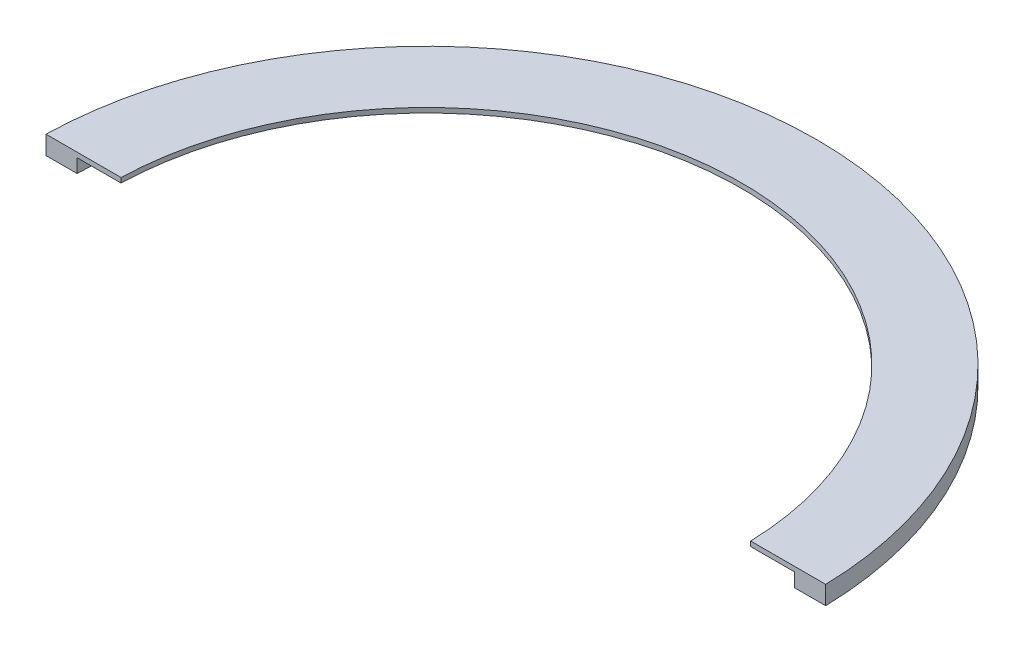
from build123d import *

# Parameters (mm, degrees)
CUT_EXTRUDE1_REACH = 190.692
SKETCH2_W          = 271.78
SKETCH2_H          = 136.525


with BuildPart() as part:
    # Sketch1 → Revolve1 (revolve)
    with BuildSketch(Plane.XY, mode=Mode.PRIVATE) as revolve1_sk:
        Polygon((-107.696, 1.651), (-133.35, 1.651), (-133.35, -4.699), (-122.7582, -4.699), (-122.7582, 0), (-107.696, 0), align=None)
    revolve(revolve1_sk.sketch.rotate(Axis((0, 0, 0), (0, 1, 0)), 270), axis=Axis((0, 0, 0), (0, 1, 0)))

    # Sketch2 → Cut-Extrude1 (cut, up to next)
    with BuildSketch(Plane(origin=(0, 1.651, 0), x_dir=(1, 0, 0), z_dir=(0, 1, 0)), mode=Mode.PRIVATE) as cut_extrude1_sk1:
        with Locations((0, -65.0875)):
            Rectangle(SKETCH2_W, SKETCH2_H)
    cut_extrude1_tool1 = extrude(cut_extrude1_sk1.sketch, amount=-CUT_EXTRUDE1_REACH, mode=Mode.PRIVATE) & part.part
    add(cut_extrude1_tool1.solids().sort_by_distance((0, 1.651, 65.0875))[0], mode=Mode.SUBTRACT)


solid = part.part
